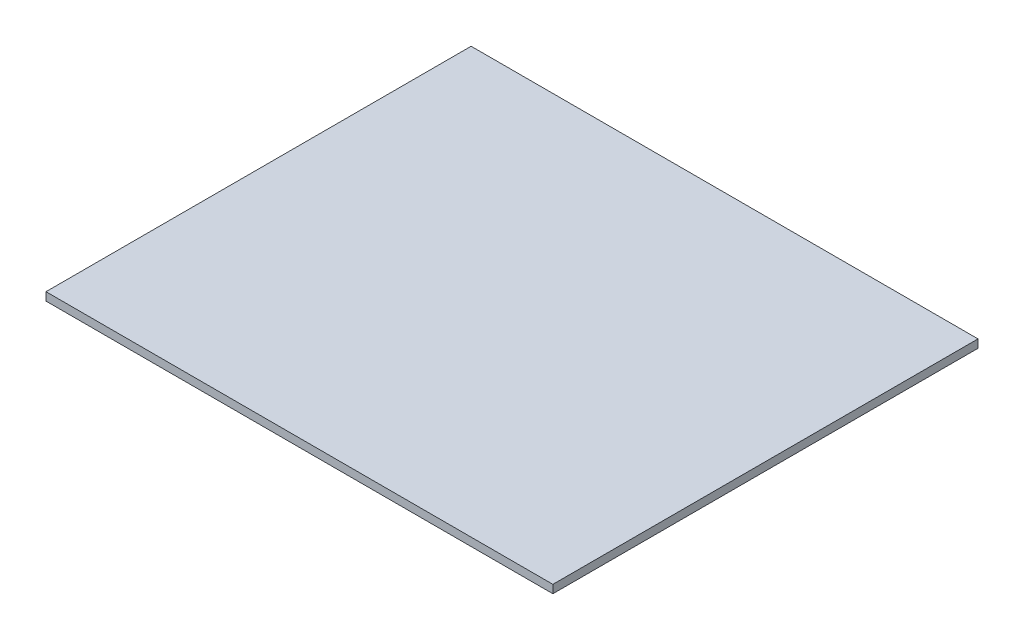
ISO-10303-21;
HEADER;
FILE_DESCRIPTION(('STEP AP214'),'2;1');
FILE_NAME('part.step','',(''),(''),'','','');
FILE_SCHEMA(('AUTOMOTIVE_DESIGN { 1 0 10303 214 1 1 1 1 }'));
ENDSEC;
DATA;
#1=APPLICATION_CONTEXT('core data for automotive mechanical design processes');
#2=APPLICATION_PROTOCOL_DEFINITION('international standard','automotive_design',2000,#1);
#3=PRODUCT_CONTEXT('',#1,'mechanical');
#4=PRODUCT('Part','Part','',(#3));
#5=PRODUCT_RELATED_PRODUCT_CATEGORY('part','',(#4));
#6=PRODUCT_DEFINITION_FORMATION('','',#4);
#7=PRODUCT_DEFINITION_CONTEXT('part definition',#1,'design');
#8=PRODUCT_DEFINITION('design','',#6,#7);
#9=PRODUCT_DEFINITION_SHAPE('','',#8);
#10=(LENGTH_UNIT() NAMED_UNIT(*) SI_UNIT(.MILLI.,.METRE.));
#11=(NAMED_UNIT(*) PLANE_ANGLE_UNIT() SI_UNIT($,.RADIAN.));
#12=(NAMED_UNIT(*) SI_UNIT($,.STERADIAN.) SOLID_ANGLE_UNIT());
#13=UNCERTAINTY_MEASURE_WITH_UNIT(LENGTH_MEASURE(1.E-05),#10,'distance_accuracy_value','');
#14=(GEOMETRIC_REPRESENTATION_CONTEXT(3) GLOBAL_UNCERTAINTY_ASSIGNED_CONTEXT((#13)) GLOBAL_UNIT_ASSIGNED_CONTEXT((#10,
#11,#12)) REPRESENTATION_CONTEXT('',''));
#15=CARTESIAN_POINT('',(0.,0.,0.));
#16=DIRECTION('',(0.,0.,1.));
#17=DIRECTION('',(1.,0.,0.));
#18=AXIS2_PLACEMENT_3D('',#15,#16,#17);
#19=CARTESIAN_POINT('',(0.,20.,0.));
#20=DIRECTION('',(1.,0.,0.));
#21=DIRECTION('',(0.,0.,-1.));
#22=AXIS2_PLACEMENT_3D('',#19,#20,#21);
#23=PLANE('',#22);
#24=DIRECTION('',(0.,0.,1.));
#25=VECTOR('',#24,1.);
#26=CARTESIAN_POINT('',(0.,0.,0.));
#27=LINE('',#26,#25);
#28=CARTESIAN_POINT('',(0.,0.,-1040.));
#29=VERTEX_POINT('',#28);
#30=CARTESIAN_POINT('',(0.,0.,0.));
#31=VERTEX_POINT('',#30);
#32=EDGE_CURVE('E241',#29,#31,#27,.T.);
#33=ORIENTED_EDGE('',*,*,#32,.T.);
#34=DIRECTION('',(0.,-1.,0.));
#35=VECTOR('',#34,1.);
#36=CARTESIAN_POINT('',(0.,20.,0.));
#37=LINE('',#36,#35);
#38=CARTESIAN_POINT('',(0.,20.,0.));
#39=VERTEX_POINT('',#38);
#40=EDGE_CURVE('E279',#39,#31,#37,.T.);
#41=ORIENTED_EDGE('',*,*,#40,.F.);
#42=DIRECTION('',(0.,0.,1.));
#43=VECTOR('',#42,1.);
#44=CARTESIAN_POINT('',(0.,20.,0.));
#45=LINE('',#44,#43);
#46=CARTESIAN_POINT('',(0.,20.,-1040.));
#47=VERTEX_POINT('',#46);
#48=EDGE_CURVE('E242',#47,#39,#45,.T.);
#49=ORIENTED_EDGE('',*,*,#48,.F.);
#50=DIRECTION('',(0.,-1.,0.));
#51=VECTOR('',#50,1.);
#52=CARTESIAN_POINT('',(0.,20.,-1040.));
#53=LINE('',#52,#51);
#54=EDGE_CURVE('E256',#47,#29,#53,.T.);
#55=ORIENTED_EDGE('',*,*,#54,.T.);
#56=EDGE_LOOP('',(#33,#41,#49,#55));
#57=FACE_BOUND('',#56,.T.);
#58=ADVANCED_FACE('F49',(#57),#23,.F.);
#59=CARTESIAN_POINT('',(0.,20.,0.));
#60=DIRECTION('',(0.,0.,-1.));
#61=DIRECTION('',(-1.,0.,0.));
#62=AXIS2_PLACEMENT_3D('',#59,#60,#61);
#63=PLANE('',#62);
#64=DIRECTION('',(1.,0.,0.));
#65=VECTOR('',#64,1.);
#66=CARTESIAN_POINT('',(0.,0.,0.));
#67=LINE('',#66,#65);
#68=CARTESIAN_POINT('',(1240.,0.,0.));
#69=VERTEX_POINT('',#68);
#70=EDGE_CURVE('E260',#31,#69,#67,.T.);
#71=ORIENTED_EDGE('',*,*,#70,.T.);
#72=DIRECTION('',(0.,-1.,0.));
#73=VECTOR('',#72,1.);
#74=CARTESIAN_POINT('',(1240.,20.,0.));
#75=LINE('',#74,#73);
#76=CARTESIAN_POINT('',(1240.,20.,0.));
#77=VERTEX_POINT('',#76);
#78=EDGE_CURVE('E275',#77,#69,#75,.T.);
#79=ORIENTED_EDGE('',*,*,#78,.F.);
#80=DIRECTION('',(1.,0.,0.));
#81=VECTOR('',#80,1.);
#82=CARTESIAN_POINT('',(0.,20.,0.));
#83=LINE('',#82,#81);
#84=EDGE_CURVE('E246',#39,#77,#83,.T.);
#85=ORIENTED_EDGE('',*,*,#84,.F.);
#86=ORIENTED_EDGE('',*,*,#40,.T.);
#87=EDGE_LOOP('',(#71,#79,#85,#86));
#88=FACE_BOUND('',#87,.T.);
#89=ADVANCED_FACE('F311',(#88),#63,.F.);
#90=CARTESIAN_POINT('',(1240.,20.,0.));
#91=DIRECTION('',(-1.,0.,0.));
#92=DIRECTION('',(0.,0.,1.));
#93=AXIS2_PLACEMENT_3D('',#90,#91,#92);
#94=PLANE('',#93);
#95=DIRECTION('',(0.,0.,-1.));
#96=VECTOR('',#95,1.);
#97=CARTESIAN_POINT('',(1240.,0.,0.));
#98=LINE('',#97,#96);
#99=CARTESIAN_POINT('',(1240.,0.,-1040.));
#100=VERTEX_POINT('',#99);
#101=EDGE_CURVE('E263',#69,#100,#98,.T.);
#102=ORIENTED_EDGE('',*,*,#101,.T.);
#103=DIRECTION('',(0.,-1.,0.));
#104=VECTOR('',#103,1.);
#105=CARTESIAN_POINT('',(1240.,20.,-1040.));
#106=LINE('',#105,#104);
#107=CARTESIAN_POINT('',(1240.,20.,-1040.));
#108=VERTEX_POINT('',#107);
#109=EDGE_CURVE('E271',#108,#100,#106,.T.);
#110=ORIENTED_EDGE('',*,*,#109,.F.);
#111=DIRECTION('',(0.,0.,-1.));
#112=VECTOR('',#111,1.);
#113=CARTESIAN_POINT('',(1240.,20.,0.));
#114=LINE('',#113,#112);
#115=EDGE_CURVE('E250',#77,#108,#114,.T.);
#116=ORIENTED_EDGE('',*,*,#115,.F.);
#117=ORIENTED_EDGE('',*,*,#78,.T.);
#118=EDGE_LOOP('',(#102,#110,#116,#117));
#119=FACE_BOUND('',#118,.T.);
#120=ADVANCED_FACE('F316',(#119),#94,.F.);
#121=CARTESIAN_POINT('',(0.,20.,-1040.));
#122=DIRECTION('',(0.,0.,1.));
#123=DIRECTION('',(1.,0.,0.));
#124=AXIS2_PLACEMENT_3D('',#121,#122,#123);
#125=PLANE('',#124);
#126=DIRECTION('',(-1.,0.,0.));
#127=VECTOR('',#126,1.);
#128=CARTESIAN_POINT('',(0.,0.,-1040.));
#129=LINE('',#128,#127);
#130=EDGE_CURVE('E247',#100,#29,#129,.T.);
#131=ORIENTED_EDGE('',*,*,#130,.T.);
#132=ORIENTED_EDGE('',*,*,#54,.F.);
#133=DIRECTION('',(-1.,0.,0.));
#134=VECTOR('',#133,1.);
#135=CARTESIAN_POINT('',(0.,20.,-1040.));
#136=LINE('',#135,#134);
#137=EDGE_CURVE('E253',#108,#47,#136,.T.);
#138=ORIENTED_EDGE('',*,*,#137,.F.);
#139=ORIENTED_EDGE('',*,*,#109,.T.);
#140=EDGE_LOOP('',(#131,#132,#138,#139));
#141=FACE_BOUND('',#140,.T.);
#142=ADVANCED_FACE('F332',(#141),#125,.F.);
#143=CARTESIAN_POINT('',(0.,20.,0.));
#144=DIRECTION('',(0.,-1.,0.));
#145=DIRECTION('',(0.,0.,-1.));
#146=AXIS2_PLACEMENT_3D('',#143,#144,#145);
#147=PLANE('',#146);
#148=ORIENTED_EDGE('',*,*,#48,.T.);
#149=ORIENTED_EDGE('',*,*,#84,.T.);
#150=ORIENTED_EDGE('',*,*,#115,.T.);
#151=ORIENTED_EDGE('',*,*,#137,.T.);
#152=EDGE_LOOP('',(#148,#149,#150,#151));
#153=FACE_BOUND('',#152,.T.);
#154=ADVANCED_FACE('F328',(#153),#147,.F.);
#155=CARTESIAN_POINT('',(0.,0.,0.));
#156=DIRECTION('',(0.,-1.,0.));
#157=DIRECTION('',(0.,0.,-1.));
#158=AXIS2_PLACEMENT_3D('',#155,#156,#157);
#159=PLANE('',#158);
#160=DIRECTION('',(0.,0.,1.));
#161=VECTOR('',#160,1.);
#162=CARTESIAN_POINT('',(40.,0.,0.));
#163=LINE('',#162,#161);
#164=CARTESIAN_POINT('',(40.,0.,-1000.87488663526));
#165=VERTEX_POINT('',#164);
#166=CARTESIAN_POINT('',(40.,0.,-970.760291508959));
#167=VERTEX_POINT('',#166);
#168=EDGE_CURVE('E11',#165,#167,#163,.T.);
#169=ORIENTED_EDGE('',*,*,#168,.F.);
#170=DIRECTION('',(-1.,0.,0.));
#171=VECTOR('',#170,1.);
#172=CARTESIAN_POINT('',(0.,0.,-1000.87488663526));
#173=LINE('',#172,#171);
#174=CARTESIAN_POINT('',(20.,0.,-1000.87488663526));
#175=VERTEX_POINT('',#174);
#176=EDGE_CURVE('E173',#165,#175,#173,.T.);
#177=ORIENTED_EDGE('',*,*,#176,.T.);
#178=DIRECTION('',(0.,0.,1.));
#179=VECTOR('',#178,1.);
#180=CARTESIAN_POINT('',(20.,0.,0.));
#181=LINE('',#180,#179);
#182=CARTESIAN_POINT('',(20.,0.,-970.760291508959));
#183=VERTEX_POINT('',#182);
#184=EDGE_CURVE('E288',#175,#183,#181,.T.);
#185=ORIENTED_EDGE('',*,*,#184,.T.);
#186=DIRECTION('',(-1.,0.,0.));
#187=VECTOR('',#186,1.);
#188=CARTESIAN_POINT('',(0.,0.,-970.760291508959));
#189=LINE('',#188,#187);
#190=EDGE_CURVE('E52',#167,#183,#189,.T.);
#191=ORIENTED_EDGE('',*,*,#190,.F.);
#192=EDGE_LOOP('',(#169,#177,#185,#191));
#193=FACE_BOUND('',#192,.T.);
#194=CARTESIAN_POINT('',(40.,0.,-730.185248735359));
#195=VERTEX_POINT('',#194);
#196=CARTESIAN_POINT('',(40.,0.,-700.166712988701));
#197=VERTEX_POINT('',#196);
#198=EDGE_CURVE('E59',#195,#197,#163,.T.);
#199=ORIENTED_EDGE('',*,*,#198,.F.);
#200=DIRECTION('',(-1.,0.,0.));
#201=VECTOR('',#200,1.);
#202=CARTESIAN_POINT('',(40.,0.,-730.185248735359));
#203=LINE('',#202,#201);
#204=CARTESIAN_POINT('',(20.,0.,-730.185248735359));
#205=VERTEX_POINT('',#204);
#206=EDGE_CURVE('E291',#205,#195,#203,.F.);
#207=ORIENTED_EDGE('',*,*,#206,.F.);
#208=CARTESIAN_POINT('',(20.,0.,-700.166712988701));
#209=VERTEX_POINT('',#208);
#210=EDGE_CURVE('E283',#205,#209,#181,.T.);
#211=ORIENTED_EDGE('',*,*,#210,.T.);
#212=DIRECTION('',(-1.,0.,0.));
#213=VECTOR('',#212,1.);
#214=CARTESIAN_POINT('',(40.,0.,-700.166712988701));
#215=LINE('',#214,#213);
#216=EDGE_CURVE('E287',#209,#197,#215,.F.);
#217=ORIENTED_EDGE('',*,*,#216,.T.);
#218=EDGE_LOOP('',(#199,#207,#211,#217));
#219=FACE_BOUND('',#218,.T.);
#220=DIRECTION('',(0.,0.,-1.));
#221=VECTOR('',#220,1.);
#222=CARTESIAN_POINT('',(210.,0.,-60.));
#223=LINE('',#222,#221);
#224=CARTESIAN_POINT('',(210.,0.,-60.));
#225=VERTEX_POINT('',#224);
#226=CARTESIAN_POINT('',(210.,0.,-980.));
#227=VERTEX_POINT('',#226);
#228=EDGE_CURVE('E195',#225,#227,#223,.T.);
#229=ORIENTED_EDGE('',*,*,#228,.F.);
#230=DIRECTION('',(-1.,0.,0.));
#231=VECTOR('',#230,1.);
#232=CARTESIAN_POINT('',(210.,0.,-60.));
#233=LINE('',#232,#231);
#234=CARTESIAN_POINT('',(1180.,0.,-60.));
#235=VERTEX_POINT('',#234);
#236=EDGE_CURVE('E202',#235,#225,#233,.T.);
#237=ORIENTED_EDGE('',*,*,#236,.F.);
#238=DIRECTION('',(0.,0.,1.));
#239=VECTOR('',#238,1.);
#240=CARTESIAN_POINT('',(1180.,0.,-60.));
#241=LINE('',#240,#239);
#242=CARTESIAN_POINT('',(1180.,0.,-980.));
#243=VERTEX_POINT('',#242);
#244=EDGE_CURVE('E219',#243,#235,#241,.T.);
#245=ORIENTED_EDGE('',*,*,#244,.F.);
#246=DIRECTION('',(1.,0.,0.));
#247=VECTOR('',#246,1.);
#248=CARTESIAN_POINT('',(210.,0.,-980.));
#249=LINE('',#248,#247);
#250=EDGE_CURVE('E215',#227,#243,#249,.T.);
#251=ORIENTED_EDGE('',*,*,#250,.F.);
#252=EDGE_LOOP('',(#229,#237,#245,#251));
#253=FACE_BOUND('',#252,.T.);
#254=ORIENTED_EDGE('',*,*,#32,.F.);
#255=ORIENTED_EDGE('',*,*,#130,.F.);
#256=ORIENTED_EDGE('',*,*,#101,.F.);
#257=ORIENTED_EDGE('',*,*,#70,.F.);
#258=EDGE_LOOP('',(#254,#255,#256,#257));
#259=FACE_BOUND('',#258,.T.);
#260=ADVANCED_FACE('F300',(#193,#219,#253,#259),#159,.T.);
#261=CARTESIAN_POINT('',(210.,-40.,-60.));
#262=DIRECTION('',(1.,0.,0.));
#263=DIRECTION('',(0.,0.,-1.));
#264=AXIS2_PLACEMENT_3D('',#261,#262,#263);
#265=PLANE('',#264);
#266=ORIENTED_EDGE('',*,*,#228,.T.);
#267=DIRECTION('',(0.,1.,0.));
#268=VECTOR('',#267,1.);
#269=CARTESIAN_POINT('',(210.,-40.,-980.));
#270=LINE('',#269,#268);
#271=CARTESIAN_POINT('',(210.,-40.,-980.));
#272=VERTEX_POINT('',#271);
#273=EDGE_CURVE('E237',#272,#227,#270,.T.);
#274=ORIENTED_EDGE('',*,*,#273,.F.);
#275=DIRECTION('',(0.,0.,-1.));
#276=VECTOR('',#275,1.);
#277=CARTESIAN_POINT('',(210.,-40.,-60.));
#278=LINE('',#277,#276);
#279=CARTESIAN_POINT('',(210.,-40.,-60.));
#280=VERTEX_POINT('',#279);
#281=EDGE_CURVE('E197',#280,#272,#278,.T.);
#282=ORIENTED_EDGE('',*,*,#281,.F.);
#283=DIRECTION('',(0.,1.,0.));
#284=VECTOR('',#283,1.);
#285=CARTESIAN_POINT('',(210.,-40.,-60.));
#286=LINE('',#285,#284);
#287=EDGE_CURVE('E211',#280,#225,#286,.T.);
#288=ORIENTED_EDGE('',*,*,#287,.T.);
#289=EDGE_LOOP('',(#266,#274,#282,#288));
#290=FACE_BOUND('',#289,.T.);
#291=ADVANCED_FACE('F343',(#290),#265,.F.);
#292=CARTESIAN_POINT('',(210.,-40.,-980.));
#293=DIRECTION('',(0.,0.,1.));
#294=DIRECTION('',(1.,0.,0.));
#295=AXIS2_PLACEMENT_3D('',#292,#293,#294);
#296=PLANE('',#295);
#297=ORIENTED_EDGE('',*,*,#250,.T.);
#298=DIRECTION('',(0.,1.,0.));
#299=VECTOR('',#298,1.);
#300=CARTESIAN_POINT('',(1180.,-40.,-980.));
#301=LINE('',#300,#299);
#302=CARTESIAN_POINT('',(1180.,-40.,-980.));
#303=VERTEX_POINT('',#302);
#304=EDGE_CURVE('E233',#303,#243,#301,.T.);
#305=ORIENTED_EDGE('',*,*,#304,.F.);
#306=DIRECTION('',(1.,0.,0.));
#307=VECTOR('',#306,1.);
#308=CARTESIAN_POINT('',(210.,-40.,-980.));
#309=LINE('',#308,#307);
#310=EDGE_CURVE('E201',#272,#303,#309,.T.);
#311=ORIENTED_EDGE('',*,*,#310,.F.);
#312=ORIENTED_EDGE('',*,*,#273,.T.);
#313=EDGE_LOOP('',(#297,#305,#311,#312));
#314=FACE_BOUND('',#313,.T.);
#315=ADVANCED_FACE('F348',(#314),#296,.F.);
#316=CARTESIAN_POINT('',(1180.,-40.,-60.));
#317=DIRECTION('',(-1.,0.,0.));
#318=DIRECTION('',(0.,0.,1.));
#319=AXIS2_PLACEMENT_3D('',#316,#317,#318);
#320=PLANE('',#319);
#321=ORIENTED_EDGE('',*,*,#244,.T.);
#322=DIRECTION('',(0.,1.,0.));
#323=VECTOR('',#322,1.);
#324=CARTESIAN_POINT('',(1180.,-40.,-60.));
#325=LINE('',#324,#323);
#326=CARTESIAN_POINT('',(1180.,-40.,-60.));
#327=VERTEX_POINT('',#326);
#328=EDGE_CURVE('E229',#327,#235,#325,.T.);
#329=ORIENTED_EDGE('',*,*,#328,.F.);
#330=DIRECTION('',(0.,0.,1.));
#331=VECTOR('',#330,1.);
#332=CARTESIAN_POINT('',(1180.,-40.,-60.));
#333=LINE('',#332,#331);
#334=EDGE_CURVE('E205',#303,#327,#333,.T.);
#335=ORIENTED_EDGE('',*,*,#334,.F.);
#336=ORIENTED_EDGE('',*,*,#304,.T.);
#337=EDGE_LOOP('',(#321,#329,#335,#336));
#338=FACE_BOUND('',#337,.T.);
#339=ADVANCED_FACE('F352',(#338),#320,.F.);
#340=CARTESIAN_POINT('',(210.,-40.,-60.));
#341=DIRECTION('',(0.,0.,-1.));
#342=DIRECTION('',(-1.,0.,0.));
#343=AXIS2_PLACEMENT_3D('',#340,#341,#342);
#344=PLANE('',#343);
#345=ORIENTED_EDGE('',*,*,#236,.T.);
#346=ORIENTED_EDGE('',*,*,#287,.F.);
#347=DIRECTION('',(-1.,0.,0.));
#348=VECTOR('',#347,1.);
#349=CARTESIAN_POINT('',(210.,-40.,-60.));
#350=LINE('',#349,#348);
#351=EDGE_CURVE('E208',#327,#280,#350,.T.);
#352=ORIENTED_EDGE('',*,*,#351,.F.);
#353=ORIENTED_EDGE('',*,*,#328,.T.);
#354=EDGE_LOOP('',(#345,#346,#352,#353));
#355=FACE_BOUND('',#354,.T.);
#356=ADVANCED_FACE('F356',(#355),#344,.F.);
#357=CARTESIAN_POINT('',(0.,-40.,0.));
#358=DIRECTION('',(0.,-1.,0.));
#359=DIRECTION('',(0.,0.,-1.));
#360=AXIS2_PLACEMENT_3D('',#357,#358,#359);
#361=PLANE('',#360);
#362=ORIENTED_EDGE('',*,*,#281,.T.);
#363=ORIENTED_EDGE('',*,*,#310,.T.);
#364=ORIENTED_EDGE('',*,*,#334,.T.);
#365=ORIENTED_EDGE('',*,*,#351,.T.);
#366=EDGE_LOOP('',(#362,#363,#364,#365));
#367=FACE_BOUND('',#366,.T.);
#368=ADVANCED_FACE('F360',(#367),#361,.T.);
#369=CARTESIAN_POINT('',(40.,7.38532771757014,-970.114159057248));
#370=DIRECTION('',(0.,-0.0871557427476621,0.996194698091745));
#371=DIRECTION('',(0.,-0.996194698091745,-0.0871557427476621));
#372=AXIS2_PLACEMENT_3D('',#369,#370,#371);
#373=PLANE('',#372);
#374=DIRECTION('',(0.,0.996194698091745,0.0871557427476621));
#375=VECTOR('',#374,1.);
#376=CARTESIAN_POINT('',(40.,7.38532771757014,-970.114159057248));
#377=LINE('',#376,#375);
#378=CARTESIAN_POINT('',(40.,-259.921759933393,-993.500498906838));
#379=VERTEX_POINT('',#378);
#380=EDGE_CURVE('E175',#379,#167,#377,.T.);
#381=ORIENTED_EDGE('',*,*,#380,.T.);
#382=ORIENTED_EDGE('',*,*,#190,.T.);
#383=DIRECTION('',(0.,0.996194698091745,0.0871557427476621));
#384=VECTOR('',#383,1.);
#385=CARTESIAN_POINT('',(20.,7.38532771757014,-970.114159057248));
#386=LINE('',#385,#384);
#387=CARTESIAN_POINT('',(20.,-259.921759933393,-993.500498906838));
#388=VERTEX_POINT('',#387);
#389=EDGE_CURVE('E66',#388,#183,#386,.T.);
#390=ORIENTED_EDGE('',*,*,#389,.F.);
#391=DIRECTION('',(-1.,0.,0.));
#392=VECTOR('',#391,1.);
#393=CARTESIAN_POINT('',(40.,-259.921759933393,-993.500498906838));
#394=LINE('',#393,#392);
#395=EDGE_CURVE('E169',#379,#388,#394,.T.);
#396=ORIENTED_EDGE('',*,*,#395,.F.);
#397=EDGE_LOOP('',(#381,#382,#390,#396));
#398=FACE_BOUND('',#397,.T.);
#399=ADVANCED_FACE('F364',(#398),#373,.T.);
#400=CARTESIAN_POINT('',(40.,10.,-1000.));
#401=DIRECTION('',(-1.,0.,0.));
#402=DIRECTION('',(0.,0.,1.));
#403=AXIS2_PLACEMENT_3D('',#400,#401,#402);
#404=CYLINDRICAL_SURFACE('',#403,270.);
#405=CARTESIAN_POINT('',(20.,10.,-1000.));
#406=DIRECTION('',(-1.,0.,0.));
#407=DIRECTION('',(0.,0.,1.));
#408=AXIS2_PLACEMENT_3D('',#405,#406,#407);
#409=CIRCLE('',#408,270.);
#410=EDGE_CURVE('E179',#205,#388,#409,.F.);
#411=ORIENTED_EDGE('',*,*,#410,.F.);
#412=ORIENTED_EDGE('',*,*,#206,.T.);
#413=CARTESIAN_POINT('',(40.,10.,-1000.));
#414=DIRECTION('',(-1.,0.,0.));
#415=DIRECTION('',(0.,0.,1.));
#416=AXIS2_PLACEMENT_3D('',#413,#414,#415);
#417=CIRCLE('',#416,270.);
#418=EDGE_CURVE('E161',#195,#379,#417,.F.);
#419=ORIENTED_EDGE('',*,*,#418,.T.);
#420=ORIENTED_EDGE('',*,*,#395,.T.);
#421=EDGE_LOOP('',(#411,#412,#419,#420));
#422=FACE_BOUND('',#421,.T.);
#423=ADVANCED_FACE('F368',(#422),#404,.F.);
#424=CARTESIAN_POINT('',(40.,10.,-1000.));
#425=DIRECTION('',(-1.,0.,0.));
#426=DIRECTION('',(0.,0.,1.));
#427=AXIS2_PLACEMENT_3D('',#424,#425,#426);
#428=CYLINDRICAL_SURFACE('',#427,300.);
#429=ORIENTED_EDGE('',*,*,#216,.F.);
#430=CARTESIAN_POINT('',(20.,10.,-1000.));
#431=DIRECTION('',(1.,0.,0.));
#432=DIRECTION('',(0.,0.,-1.));
#433=AXIS2_PLACEMENT_3D('',#430,#431,#432);
#434=CIRCLE('',#433,300.);
#435=CARTESIAN_POINT('',(20.,-288.858409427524,-1026.1467228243));
#436=VERTEX_POINT('',#435);
#437=EDGE_CURVE('E73',#209,#436,#434,.T.);
#438=ORIENTED_EDGE('',*,*,#437,.T.);
#439=DIRECTION('',(-1.,0.,0.));
#440=VECTOR('',#439,1.);
#441=CARTESIAN_POINT('',(40.,-288.858409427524,-1026.1467228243));
#442=LINE('',#441,#440);
#443=CARTESIAN_POINT('',(40.,-288.858409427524,-1026.1467228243));
#444=VERTEX_POINT('',#443);
#445=EDGE_CURVE('E164',#444,#436,#442,.T.);
#446=ORIENTED_EDGE('',*,*,#445,.F.);
#447=CARTESIAN_POINT('',(40.,10.,-1000.));
#448=DIRECTION('',(1.,0.,0.));
#449=DIRECTION('',(0.,0.,-1.));
#450=AXIS2_PLACEMENT_3D('',#447,#448,#449);
#451=CIRCLE('',#450,300.);
#452=EDGE_CURVE('E150',#197,#444,#451,.T.);
#453=ORIENTED_EDGE('',*,*,#452,.F.);
#454=EDGE_LOOP('',(#429,#438,#446,#453));
#455=FACE_BOUND('',#454,.T.);
#456=ADVANCED_FACE('F165',(#455),#428,.T.);
#457=CARTESIAN_POINT('',(40.,10.,-1000.));
#458=DIRECTION('',(0.,-0.0871557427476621,0.996194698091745));
#459=DIRECTION('',(0.,-0.996194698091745,-0.0871557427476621));
#460=AXIS2_PLACEMENT_3D('',#457,#458,#459);
#461=PLANE('',#460);
#462=ORIENTED_EDGE('',*,*,#176,.F.);
#463=DIRECTION('',(0.,0.996194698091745,0.0871557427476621));
#464=VECTOR('',#463,1.);
#465=CARTESIAN_POINT('',(40.,10.,-1000.));
#466=LINE('',#465,#464);
#467=EDGE_CURVE('E154',#444,#165,#466,.T.);
#468=ORIENTED_EDGE('',*,*,#467,.F.);
#469=ORIENTED_EDGE('',*,*,#445,.T.);
#470=DIRECTION('',(0.,0.996194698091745,0.0871557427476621));
#471=VECTOR('',#470,1.);
#472=CARTESIAN_POINT('',(20.,10.,-1000.));
#473=LINE('',#472,#471);
#474=EDGE_CURVE('E186',#436,#175,#473,.T.);
#475=ORIENTED_EDGE('',*,*,#474,.T.);
#476=EDGE_LOOP('',(#462,#468,#469,#475));
#477=FACE_BOUND('',#476,.T.);
#478=ADVANCED_FACE('F171',(#477),#461,.F.);
#479=CARTESIAN_POINT('',(40.,10.,-1000.));
#480=DIRECTION('',(1.,0.,0.));
#481=DIRECTION('',(0.,0.,-1.));
#482=AXIS2_PLACEMENT_3D('',#479,#480,#481);
#483=PLANE('',#482);
#484=ORIENTED_EDGE('',*,*,#467,.T.);
#485=ORIENTED_EDGE('',*,*,#168,.T.);
#486=ORIENTED_EDGE('',*,*,#380,.F.);
#487=ORIENTED_EDGE('',*,*,#418,.F.);
#488=ORIENTED_EDGE('',*,*,#198,.T.);
#489=ORIENTED_EDGE('',*,*,#452,.T.);
#490=EDGE_LOOP('',(#484,#485,#486,#487,#488,#489));
#491=FACE_BOUND('',#490,.T.);
#492=ADVANCED_FACE('F152',(#491),#483,.T.);
#493=CARTESIAN_POINT('',(20.,10.,-1000.));
#494=DIRECTION('',(1.,0.,0.));
#495=DIRECTION('',(0.,0.,-1.));
#496=AXIS2_PLACEMENT_3D('',#493,#494,#495);
#497=PLANE('',#496);
#498=ORIENTED_EDGE('',*,*,#184,.F.);
#499=ORIENTED_EDGE('',*,*,#474,.F.);
#500=ORIENTED_EDGE('',*,*,#437,.F.);
#501=ORIENTED_EDGE('',*,*,#210,.F.);
#502=ORIENTED_EDGE('',*,*,#410,.T.);
#503=ORIENTED_EDGE('',*,*,#389,.T.);
#504=EDGE_LOOP('',(#498,#499,#500,#501,#502,#503));
#505=FACE_BOUND('',#504,.T.);
#506=ADVANCED_FACE('F302',(#505),#497,.F.);
#507=CLOSED_SHELL('',(#58,#89,#120,#142,#154,#260,#291,#315,#339,#356,#368,#399,#423,#456,#478,
#492,#506));
#508=MANIFOLD_SOLID_BREP('B2',#507);
#509=ADVANCED_BREP_SHAPE_REPRESENTATION('',(#18,#508),#14);
#510=SHAPE_DEFINITION_REPRESENTATION(#9,#509);
ENDSEC;
END-ISO-10303-21;
